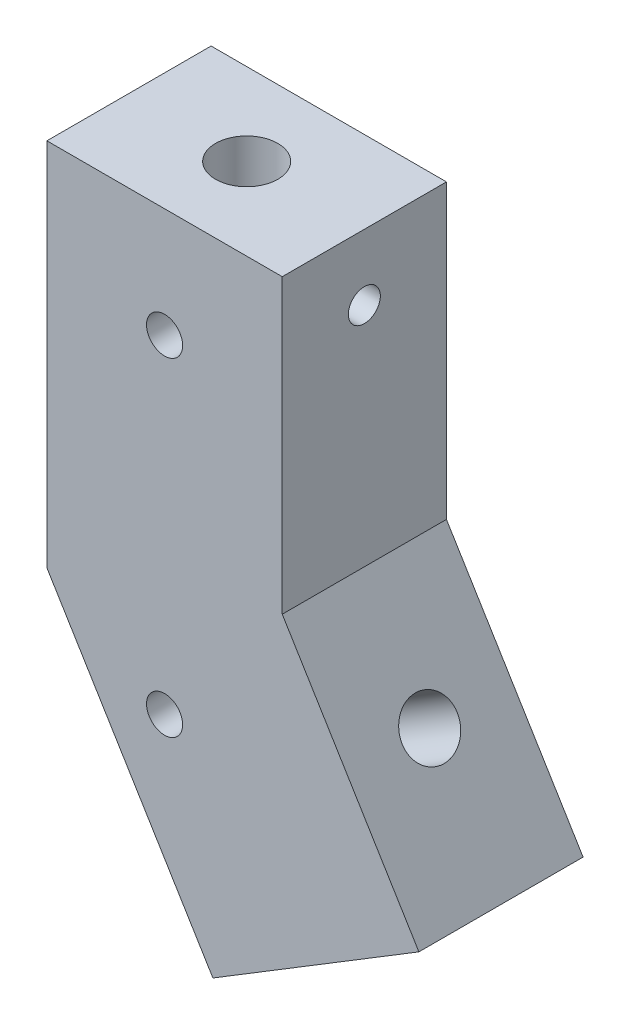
from build123d import *

# Parameters (mm, degrees)
BOSS_EXTRU_1_DEPTH      = 15
ESQUISSE2_R             = 5.688820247
ENL_V_MAT_EXTRU_1_DEPTH = 30
ESQUISSE3_R             = 5.028993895
ENL_V_MAT_EXTRU_2_DEPTH = 523.590019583
ESQUISSE4_R             = 3.3
ESQUISSE4_W             = 47.04151598
ESQUISSE4_H             = 80.116997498
ENL_V_MAT_EXTRU_3_DEPTH = 555.949410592
ESQUISSE5_R             = 2.925
ENL_V_MAT_EXTRU_4_DEPTH = 529.535354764


with BuildPart() as part:
    # Esquisse1 → Boss.-Extru.1 (new, symmetric)
    with BuildSketch(Plane.XY):
        Polygon((-62.700312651, -406.626506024), (62.700312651, -406.626506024), (111.720378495, -487.019414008), (20.307346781, -542.759067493), align=None)
    extrude(amount=BOSS_EXTRU_1_DEPTH, both=True)

    # Esquisse2 → Enl_v. mat.-Extru.1 (cut)
    with BuildSketch(Plane(origin=(0, -406.626506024, 0), x_dir=(1, 0, 0), z_dir=(0, 1, 0))):
        with Locations(Location((0, 0, 0), (0, 0, 270))):
            Circle(ESQUISSE2_R)
    extrude(amount=-ENL_V_MAT_EXTRU_1_DEPTH, mode=Mode.SUBTRACT)

    # Esquisse3 → Enl_v. mat.-Extru.2 (cut, through all)
    with BuildSketch(Plane(origin=(-135.03596839, -82.339005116, 0), x_dir=(0, 0, -1), z_dir=(0.8537961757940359, 0.5206074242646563, 0))):
        with Locations(Location((0, -426.898087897, 0), (0, 0, 90))):
            Circle(ESQUISSE3_R)
    extrude(amount=-ENL_V_MAT_EXTRU_2_DEPTH, mode=Mode.SUBTRACT)

    # Esquisse4 → Enl_v. mat.-Extru.3 (cut, through all)
    with BuildSketch(Plane.XY.offset(15)):
        with Locations((0, -426.626506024)):
            Circle(ESQUISSE4_R)
        with Locations((0, -486.626506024)):
            Circle(ESQUISSE4_R)
        Polygon((46.46760096, -500.981048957), (21.5, -460.034183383), (21.5, -402.104856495), (129.723921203, -402.104856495), (129.723921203, -519.807843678), (57.947353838, -519.807843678), (12.614518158, -547.449816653), (1.13476528, -528.623021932), align=None)
        with Locations((-45.02075799, -442.163355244)):
            Rectangle(ESQUISSE4_W, ESQUISSE4_H)
    extrude(amount=-ENL_V_MAT_EXTRU_3_DEPTH, mode=Mode.SUBTRACT)

    # Esquisse5 → Enl_v. mat.-Extru.4 (cut, through all)
    with BuildSketch(Plane.ZY.offset(21.5)):
        with Locations((0, -418.626506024)):
            Circle(ESQUISSE5_R)
    extrude(amount=-ENL_V_MAT_EXTRU_4_DEPTH, mode=Mode.SUBTRACT)


solid = part.part
